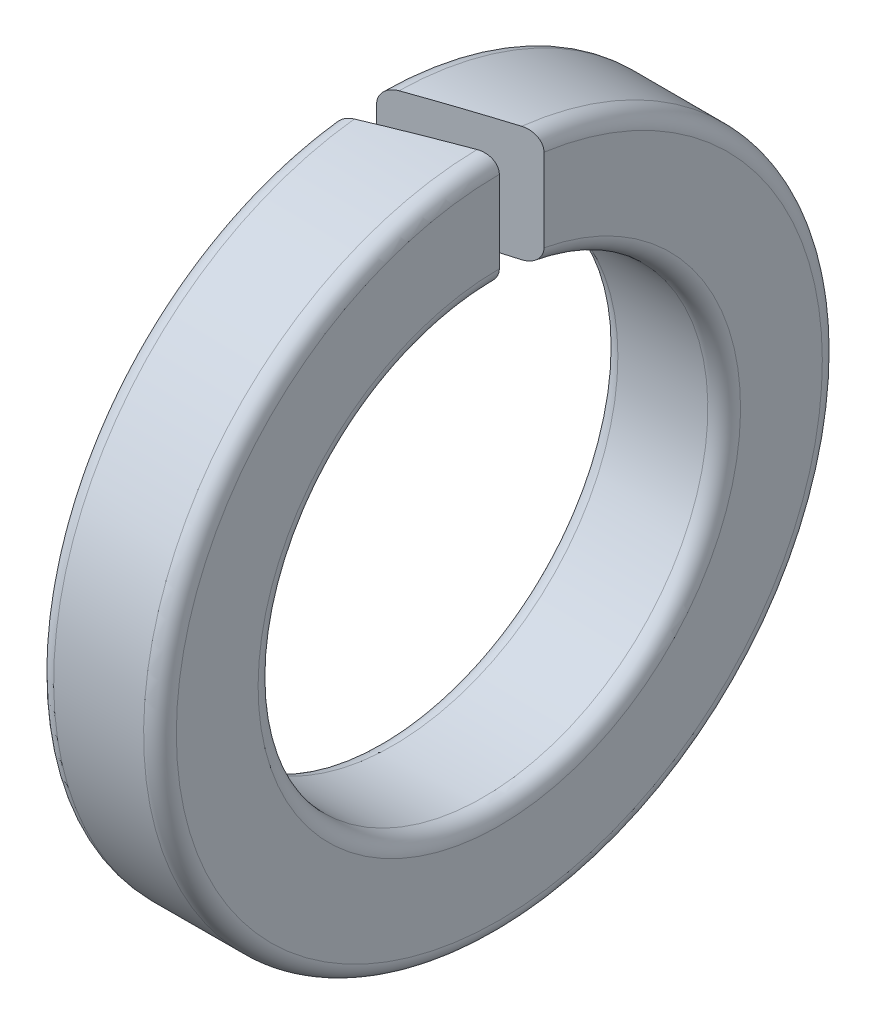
from build123d import *

# Parameters (mm, degrees)
ESQUISSE1_W             = 1.5
ESQUISSE1_H             = 1.4
ENL_V_MAT_EXTRU_1_DEPTH = 7.057639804
CONG_1_R                = 0.2


with BuildPart() as part:
    # Esquisse1 → Base-R_volution (revolve)
    with BuildSketch(Plane(origin=(0, 0, 0), x_dir=(1, 0, 0), z_dir=(0, 1, 0)), mode=Mode.PRIVATE) as base_r_volution_sk:
        with Locations((0.75, 3.45)):
            Rectangle(ESQUISSE1_W, ESQUISSE1_H)
    revolve(base_r_volution_sk.sketch.rotate(Axis((0, 0, 0), (1, 0, 0)), 180), axis=Axis((0, 0, 0), (1, 0, 0)))

    # Esquisse2 → Enl_v. mat.-Extru.1 (cut, through all)
    with BuildSketch(Plane(origin=(0, 0, 0), x_dir=(1, 0, 0), z_dir=(0, 1, 0))):
        Polygon((0, 0), (1.5, 0.545955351), (1.5, 0), (0, -0.545955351), align=None)
    extrude(amount=ENL_V_MAT_EXTRU_1_DEPTH, mode=Mode.SUBTRACT)

    # Cong_1
    cong_1_edges = [part.edges().sort_by_distance(p)[0] for p in [
        (1.5, -3.121555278, -2.734664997),
        (0, -2.934493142, -2.934493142),
        (1.5, -2.128835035, -1.740850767),
        (0, -1.944543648, -1.944543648),
    ]]
    fillet(cong_1_edges, radius=CONG_1_R)


solid = part.part
